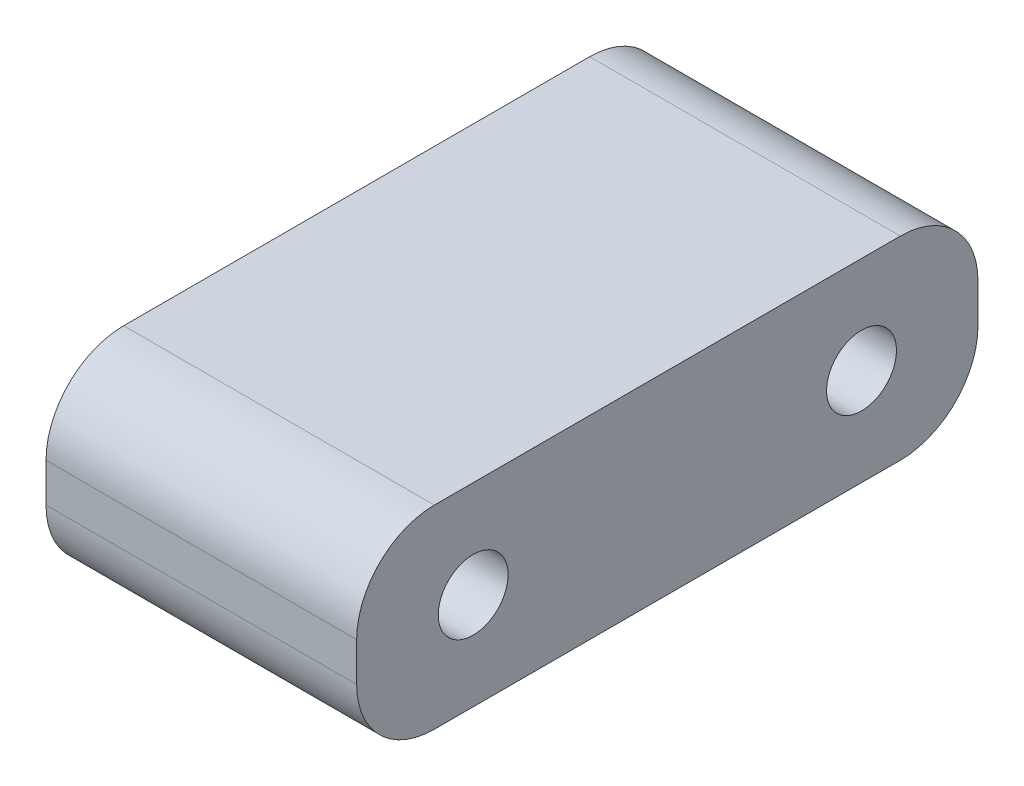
ISO-10303-21;
HEADER;
FILE_DESCRIPTION(('STEP AP214'),'2;1');
FILE_NAME('part.step','',(''),(''),'','','');
FILE_SCHEMA(('AUTOMOTIVE_DESIGN { 1 0 10303 214 1 1 1 1 }'));
ENDSEC;
DATA;
#1=APPLICATION_CONTEXT('core data for automotive mechanical design processes');
#2=APPLICATION_PROTOCOL_DEFINITION('international standard','automotive_design',2000,#1);
#3=PRODUCT_CONTEXT('',#1,'mechanical');
#4=PRODUCT('Part','Part','',(#3));
#5=PRODUCT_RELATED_PRODUCT_CATEGORY('part','',(#4));
#6=PRODUCT_DEFINITION_FORMATION('','',#4);
#7=PRODUCT_DEFINITION_CONTEXT('part definition',#1,'design');
#8=PRODUCT_DEFINITION('design','',#6,#7);
#9=PRODUCT_DEFINITION_SHAPE('','',#8);
#10=(LENGTH_UNIT() NAMED_UNIT(*) SI_UNIT(.MILLI.,.METRE.));
#11=(NAMED_UNIT(*) PLANE_ANGLE_UNIT() SI_UNIT($,.RADIAN.));
#12=(NAMED_UNIT(*) SI_UNIT($,.STERADIAN.) SOLID_ANGLE_UNIT());
#13=UNCERTAINTY_MEASURE_WITH_UNIT(LENGTH_MEASURE(1.E-05),#10,'distance_accuracy_value','');
#14=(GEOMETRIC_REPRESENTATION_CONTEXT(3) GLOBAL_UNCERTAINTY_ASSIGNED_CONTEXT((#13)) GLOBAL_UNIT_ASSIGNED_CONTEXT((#10,
#11,#12)) REPRESENTATION_CONTEXT('',''));
#15=CARTESIAN_POINT('',(0.,0.,0.));
#16=DIRECTION('',(0.,0.,1.));
#17=DIRECTION('',(1.,0.,0.));
#18=AXIS2_PLACEMENT_3D('',#15,#16,#17);
#19=CARTESIAN_POINT('',(10.,0.531417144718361,0.));
#20=DIRECTION('',(0.,1.,0.));
#21=DIRECTION('',(0.,0.,1.));
#22=AXIS2_PLACEMENT_3D('',#19,#20,#21);
#23=PLANE('',#22);
#24=DIRECTION('',(0.,0.,-1.));
#25=VECTOR('',#24,1.);
#26=CARTESIAN_POINT('',(-10.,0.531417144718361,0.));
#27=LINE('',#26,#25);
#28=CARTESIAN_POINT('',(-10.,0.531417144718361,-2.75000000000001));
#29=VERTEX_POINT('',#28);
#30=CARTESIAN_POINT('',(-10.,0.531417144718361,-32.75));
#31=VERTEX_POINT('',#30);
#32=EDGE_CURVE('E141',#29,#31,#27,.T.);
#33=ORIENTED_EDGE('',*,*,#32,.T.);
#34=DIRECTION('',(-1.,0.,0.));
#35=VECTOR('',#34,1.);
#36=CARTESIAN_POINT('',(10.,0.531417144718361,-32.75));
#37=LINE('',#36,#35);
#38=CARTESIAN_POINT('',(10.,0.531417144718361,-32.75));
#39=VERTEX_POINT('',#38);
#40=EDGE_CURVE('E11',#39,#31,#37,.T.);
#41=ORIENTED_EDGE('',*,*,#40,.F.);
#42=DIRECTION('',(0.,0.,-1.));
#43=VECTOR('',#42,1.);
#44=CARTESIAN_POINT('',(10.,0.531417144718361,0.));
#45=LINE('',#44,#43);
#46=CARTESIAN_POINT('',(10.,0.531417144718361,-2.75000000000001));
#47=VERTEX_POINT('',#46);
#48=EDGE_CURVE('E168',#47,#39,#45,.T.);
#49=ORIENTED_EDGE('',*,*,#48,.F.);
#50=DIRECTION('',(-1.,0.,0.));
#51=VECTOR('',#50,1.);
#52=CARTESIAN_POINT('',(10.,0.531417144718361,-2.75000000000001));
#53=LINE('',#52,#51);
#54=EDGE_CURVE('E137',#47,#29,#53,.T.);
#55=ORIENTED_EDGE('',*,*,#54,.T.);
#56=EDGE_LOOP('',(#33,#41,#49,#55));
#57=FACE_BOUND('',#56,.T.);
#58=ADVANCED_FACE('F40',(#57),#23,.F.);
#59=CARTESIAN_POINT('',(10.,5.53141714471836,-32.75));
#60=DIRECTION('',(-1.,0.,0.));
#61=DIRECTION('',(0.,0.,1.));
#62=AXIS2_PLACEMENT_3D('',#59,#60,#61);
#63=CYLINDRICAL_SURFACE('',#62,5.);
#64=CARTESIAN_POINT('',(-10.,5.53141714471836,-32.75));
#65=DIRECTION('',(1.,0.,0.));
#66=DIRECTION('',(0.,0.,-1.));
#67=AXIS2_PLACEMENT_3D('',#64,#65,#66);
#68=CIRCLE('',#67,5.);
#69=CARTESIAN_POINT('',(-10.,5.53141714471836,-37.75));
#70=VERTEX_POINT('',#69);
#71=EDGE_CURVE('E145',#31,#70,#68,.T.);
#72=ORIENTED_EDGE('',*,*,#71,.T.);
#73=DIRECTION('',(-1.,0.,0.));
#74=VECTOR('',#73,1.);
#75=CARTESIAN_POINT('',(10.,5.53141714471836,-37.75));
#76=LINE('',#75,#74);
#77=CARTESIAN_POINT('',(10.,5.53141714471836,-37.75));
#78=VERTEX_POINT('',#77);
#79=EDGE_CURVE('E49',#78,#70,#76,.T.);
#80=ORIENTED_EDGE('',*,*,#79,.F.);
#81=CARTESIAN_POINT('',(10.,5.53141714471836,-32.75));
#82=DIRECTION('',(1.,0.,0.));
#83=DIRECTION('',(0.,0.,-1.));
#84=AXIS2_PLACEMENT_3D('',#81,#82,#83);
#85=CIRCLE('',#84,5.);
#86=EDGE_CURVE('E100',#39,#78,#85,.T.);
#87=ORIENTED_EDGE('',*,*,#86,.F.);
#88=ORIENTED_EDGE('',*,*,#40,.T.);
#89=EDGE_LOOP('',(#72,#80,#87,#88));
#90=FACE_BOUND('',#89,.T.);
#91=ADVANCED_FACE('F187',(#90),#63,.T.);
#92=CARTESIAN_POINT('',(10.,0.,-37.75));
#93=DIRECTION('',(0.,0.,-1.));
#94=DIRECTION('',(-1.,0.,0.));
#95=AXIS2_PLACEMENT_3D('',#92,#93,#94);
#96=PLANE('',#95);
#97=DIRECTION('',(0.,-1.,0.));
#98=VECTOR('',#97,1.);
#99=CARTESIAN_POINT('',(-10.,0.,-37.75));
#100=LINE('',#99,#98);
#101=CARTESIAN_POINT('',(-10.,8.03141714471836,-37.75));
#102=VERTEX_POINT('',#101);
#103=EDGE_CURVE('E150',#102,#70,#100,.T.);
#104=ORIENTED_EDGE('',*,*,#103,.F.);
#105=DIRECTION('',(-1.,0.,0.));
#106=VECTOR('',#105,1.);
#107=CARTESIAN_POINT('',(10.,8.03141714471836,-37.75));
#108=LINE('',#107,#106);
#109=CARTESIAN_POINT('',(10.,8.03141714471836,-37.75));
#110=VERTEX_POINT('',#109);
#111=EDGE_CURVE('E178',#110,#102,#108,.T.);
#112=ORIENTED_EDGE('',*,*,#111,.F.);
#113=DIRECTION('',(0.,-1.,0.));
#114=VECTOR('',#113,1.);
#115=CARTESIAN_POINT('',(10.,0.,-37.75));
#116=LINE('',#115,#114);
#117=EDGE_CURVE('E186',#110,#78,#116,.T.);
#118=ORIENTED_EDGE('',*,*,#117,.T.);
#119=ORIENTED_EDGE('',*,*,#79,.T.);
#120=EDGE_LOOP('',(#104,#112,#118,#119));
#121=FACE_BOUND('',#120,.T.);
#122=ADVANCED_FACE('F184',(#121),#96,.T.);
#123=CARTESIAN_POINT('',(10.,8.03141714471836,-32.75));
#124=DIRECTION('',(-1.,0.,0.));
#125=DIRECTION('',(0.,0.,1.));
#126=AXIS2_PLACEMENT_3D('',#123,#124,#125);
#127=CYLINDRICAL_SURFACE('',#126,4.99999999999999);
#128=CARTESIAN_POINT('',(-10.,8.03141714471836,-32.75));
#129=DIRECTION('',(1.,0.,0.));
#130=DIRECTION('',(0.,0.,-1.));
#131=AXIS2_PLACEMENT_3D('',#128,#129,#130);
#132=CIRCLE('',#131,4.99999999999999);
#133=CARTESIAN_POINT('',(-10.,13.0314171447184,-32.75));
#134=VERTEX_POINT('',#133);
#135=EDGE_CURVE('E154',#134,#102,#132,.F.);
#136=ORIENTED_EDGE('',*,*,#135,.F.);
#137=DIRECTION('',(-1.,0.,0.));
#138=VECTOR('',#137,1.);
#139=CARTESIAN_POINT('',(10.,13.0314171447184,-32.75));
#140=LINE('',#139,#138);
#141=CARTESIAN_POINT('',(10.,13.0314171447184,-32.75));
#142=VERTEX_POINT('',#141);
#143=EDGE_CURVE('E175',#142,#134,#140,.T.);
#144=ORIENTED_EDGE('',*,*,#143,.F.);
#145=CARTESIAN_POINT('',(10.,8.03141714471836,-32.75));
#146=DIRECTION('',(1.,0.,0.));
#147=DIRECTION('',(0.,0.,-1.));
#148=AXIS2_PLACEMENT_3D('',#145,#146,#147);
#149=CIRCLE('',#148,4.99999999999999);
#150=EDGE_CURVE('E197',#142,#110,#149,.F.);
#151=ORIENTED_EDGE('',*,*,#150,.T.);
#152=ORIENTED_EDGE('',*,*,#111,.T.);
#153=EDGE_LOOP('',(#136,#144,#151,#152));
#154=FACE_BOUND('',#153,.T.);
#155=ADVANCED_FACE('F195',(#154),#127,.T.);
#156=CARTESIAN_POINT('',(10.,13.0314171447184,0.));
#157=DIRECTION('',(0.,1.,0.));
#158=DIRECTION('',(0.,0.,1.));
#159=AXIS2_PLACEMENT_3D('',#156,#157,#158);
#160=PLANE('',#159);
#161=DIRECTION('',(0.,0.,-1.));
#162=VECTOR('',#161,1.);
#163=CARTESIAN_POINT('',(-10.,13.0314171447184,0.));
#164=LINE('',#163,#162);
#165=CARTESIAN_POINT('',(-10.,13.0314171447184,-2.75000000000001));
#166=VERTEX_POINT('',#165);
#167=EDGE_CURVE('E158',#166,#134,#164,.T.);
#168=ORIENTED_EDGE('',*,*,#167,.F.);
#169=DIRECTION('',(-1.,0.,0.));
#170=VECTOR('',#169,1.);
#171=CARTESIAN_POINT('',(10.,13.0314171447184,-2.75000000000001));
#172=LINE('',#171,#170);
#173=CARTESIAN_POINT('',(10.,13.0314171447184,-2.75000000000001));
#174=VERTEX_POINT('',#173);
#175=EDGE_CURVE('E130',#174,#166,#172,.T.);
#176=ORIENTED_EDGE('',*,*,#175,.F.);
#177=DIRECTION('',(0.,0.,-1.));
#178=VECTOR('',#177,1.);
#179=CARTESIAN_POINT('',(10.,13.0314171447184,0.));
#180=LINE('',#179,#178);
#181=EDGE_CURVE('E121',#174,#142,#180,.T.);
#182=ORIENTED_EDGE('',*,*,#181,.T.);
#183=ORIENTED_EDGE('',*,*,#143,.T.);
#184=EDGE_LOOP('',(#168,#176,#182,#183));
#185=FACE_BOUND('',#184,.T.);
#186=ADVANCED_FACE('F207',(#185),#160,.T.);
#187=CARTESIAN_POINT('',(10.,8.03141714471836,-2.75000000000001));
#188=DIRECTION('',(-1.,0.,0.));
#189=DIRECTION('',(0.,0.,1.));
#190=AXIS2_PLACEMENT_3D('',#187,#188,#189);
#191=CYLINDRICAL_SURFACE('',#190,5.);
#192=CARTESIAN_POINT('',(-10.,8.03141714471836,-2.75000000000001));
#193=DIRECTION('',(1.,0.,0.));
#194=DIRECTION('',(0.,0.,-1.));
#195=AXIS2_PLACEMENT_3D('',#192,#193,#194);
#196=CIRCLE('',#195,5.);
#197=CARTESIAN_POINT('',(-10.,8.03141714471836,2.25));
#198=VERTEX_POINT('',#197);
#199=EDGE_CURVE('E128',#166,#198,#196,.T.);
#200=ORIENTED_EDGE('',*,*,#199,.T.);
#201=DIRECTION('',(-1.,0.,0.));
#202=VECTOR('',#201,1.);
#203=CARTESIAN_POINT('',(10.,8.03141714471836,2.25));
#204=LINE('',#203,#202);
#205=CARTESIAN_POINT('',(10.,8.03141714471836,2.25));
#206=VERTEX_POINT('',#205);
#207=EDGE_CURVE('E125',#206,#198,#204,.T.);
#208=ORIENTED_EDGE('',*,*,#207,.F.);
#209=CARTESIAN_POINT('',(10.,8.03141714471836,-2.75000000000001));
#210=DIRECTION('',(1.,0.,0.));
#211=DIRECTION('',(0.,0.,-1.));
#212=AXIS2_PLACEMENT_3D('',#209,#210,#211);
#213=CIRCLE('',#212,5.);
#214=EDGE_CURVE('E114',#174,#206,#213,.T.);
#215=ORIENTED_EDGE('',*,*,#214,.F.);
#216=ORIENTED_EDGE('',*,*,#175,.T.);
#217=EDGE_LOOP('',(#200,#208,#215,#216));
#218=FACE_BOUND('',#217,.T.);
#219=ADVANCED_FACE('F126',(#218),#191,.T.);
#220=CARTESIAN_POINT('',(10.,0.,2.24999999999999));
#221=DIRECTION('',(0.,0.,-1.));
#222=DIRECTION('',(0.,1.,0.));
#223=AXIS2_PLACEMENT_3D('',#220,#221,#222);
#224=PLANE('',#223);
#225=DIRECTION('',(0.,-1.,0.));
#226=VECTOR('',#225,1.);
#227=CARTESIAN_POINT('',(-10.,0.,2.24999999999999));
#228=LINE('',#227,#226);
#229=CARTESIAN_POINT('',(-10.,5.53141714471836,2.24999999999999));
#230=VERTEX_POINT('',#229);
#231=EDGE_CURVE('E86',#198,#230,#228,.T.);
#232=ORIENTED_EDGE('',*,*,#231,.T.);
#233=DIRECTION('',(-1.,0.,0.));
#234=VECTOR('',#233,1.);
#235=CARTESIAN_POINT('',(10.,5.53141714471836,2.24999999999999));
#236=LINE('',#235,#234);
#237=CARTESIAN_POINT('',(10.,5.53141714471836,2.24999999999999));
#238=VERTEX_POINT('',#237);
#239=EDGE_CURVE('E131',#238,#230,#236,.T.);
#240=ORIENTED_EDGE('',*,*,#239,.F.);
#241=DIRECTION('',(0.,-1.,0.));
#242=VECTOR('',#241,1.);
#243=CARTESIAN_POINT('',(10.,0.,2.24999999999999));
#244=LINE('',#243,#242);
#245=EDGE_CURVE('E118',#206,#238,#244,.T.);
#246=ORIENTED_EDGE('',*,*,#245,.F.);
#247=ORIENTED_EDGE('',*,*,#207,.T.);
#248=EDGE_LOOP('',(#232,#240,#246,#247));
#249=FACE_BOUND('',#248,.T.);
#250=ADVANCED_FACE('F133',(#249),#224,.F.);
#251=CARTESIAN_POINT('',(10.,5.53141714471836,-2.75000000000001));
#252=DIRECTION('',(-1.,0.,0.));
#253=DIRECTION('',(0.,0.,1.));
#254=AXIS2_PLACEMENT_3D('',#251,#252,#253);
#255=CYLINDRICAL_SURFACE('',#254,5.);
#256=CARTESIAN_POINT('',(-10.,5.53141714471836,-2.75000000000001));
#257=DIRECTION('',(1.,0.,0.));
#258=DIRECTION('',(0.,0.,-1.));
#259=AXIS2_PLACEMENT_3D('',#256,#257,#258);
#260=CIRCLE('',#259,5.);
#261=EDGE_CURVE('E92',#230,#29,#260,.T.);
#262=ORIENTED_EDGE('',*,*,#261,.T.);
#263=ORIENTED_EDGE('',*,*,#54,.F.);
#264=CARTESIAN_POINT('',(10.,5.53141714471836,-2.75000000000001));
#265=DIRECTION('',(1.,0.,0.));
#266=DIRECTION('',(0.,0.,-1.));
#267=AXIS2_PLACEMENT_3D('',#264,#265,#266);
#268=CIRCLE('',#267,5.);
#269=EDGE_CURVE('E57',#238,#47,#268,.T.);
#270=ORIENTED_EDGE('',*,*,#269,.F.);
#271=ORIENTED_EDGE('',*,*,#239,.T.);
#272=EDGE_LOOP('',(#262,#263,#270,#271));
#273=FACE_BOUND('',#272,.T.);
#274=ADVANCED_FACE('F210',(#273),#255,.T.);
#275=CARTESIAN_POINT('',(10.,0.,0.));
#276=DIRECTION('',(1.,0.,0.));
#277=DIRECTION('',(0.,0.,-1.));
#278=AXIS2_PLACEMENT_3D('',#275,#276,#277);
#279=PLANE('',#278);
#280=CARTESIAN_POINT('',(10.,6.78141714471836,-5.25000000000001));
#281=DIRECTION('',(1.,0.,0.));
#282=DIRECTION('',(0.,0.,-1.));
#283=AXIS2_PLACEMENT_3D('',#280,#281,#282);
#284=CIRCLE('',#283,2.25);
#285=CARTESIAN_POINT('',(10.,6.78141714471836,-7.50000000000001));
#286=VERTEX_POINT('',#285);
#287=EDGE_CURVE('E292',#286,#286,#284,.T.);
#288=ORIENTED_EDGE('',*,*,#287,.F.);
#289=EDGE_LOOP('',(#288));
#290=FACE_BOUND('',#289,.T.);
#291=CARTESIAN_POINT('',(10.,6.78141714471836,-30.25));
#292=DIRECTION('',(1.,0.,0.));
#293=DIRECTION('',(0.,0.,-1.));
#294=AXIS2_PLACEMENT_3D('',#291,#292,#293);
#295=CIRCLE('',#294,2.25);
#296=CARTESIAN_POINT('',(10.,6.78141714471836,-32.5));
#297=VERTEX_POINT('',#296);
#298=EDGE_CURVE('E300',#297,#297,#295,.T.);
#299=ORIENTED_EDGE('',*,*,#298,.F.);
#300=EDGE_LOOP('',(#299));
#301=FACE_BOUND('',#300,.T.);
#302=ORIENTED_EDGE('',*,*,#48,.T.);
#303=ORIENTED_EDGE('',*,*,#86,.T.);
#304=ORIENTED_EDGE('',*,*,#117,.F.);
#305=ORIENTED_EDGE('',*,*,#150,.F.);
#306=ORIENTED_EDGE('',*,*,#181,.F.);
#307=ORIENTED_EDGE('',*,*,#214,.T.);
#308=ORIENTED_EDGE('',*,*,#245,.T.);
#309=ORIENTED_EDGE('',*,*,#269,.T.);
#310=EDGE_LOOP('',(#302,#303,#304,#305,#306,#307,#308,#309));
#311=FACE_BOUND('',#310,.T.);
#312=ADVANCED_FACE('F116',(#290,#301,#311),#279,.T.);
#313=CARTESIAN_POINT('',(-10.,0.,0.));
#314=DIRECTION('',(1.,0.,0.));
#315=DIRECTION('',(0.,0.,-1.));
#316=AXIS2_PLACEMENT_3D('',#313,#314,#315);
#317=PLANE('',#316);
#318=CARTESIAN_POINT('',(-10.,6.78141714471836,-5.25000000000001));
#319=DIRECTION('',(1.,0.,0.));
#320=DIRECTION('',(0.,0.,-1.));
#321=AXIS2_PLACEMENT_3D('',#318,#319,#320);
#322=CIRCLE('',#321,2.25);
#323=CARTESIAN_POINT('',(-10.,6.78141714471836,-7.50000000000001));
#324=VERTEX_POINT('',#323);
#325=EDGE_CURVE('E146',#324,#324,#322,.T.);
#326=ORIENTED_EDGE('',*,*,#325,.T.);
#327=EDGE_LOOP('',(#326));
#328=FACE_BOUND('',#327,.T.);
#329=CARTESIAN_POINT('',(-10.,6.78141714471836,-30.25));
#330=DIRECTION('',(1.,0.,0.));
#331=DIRECTION('',(0.,0.,-1.));
#332=AXIS2_PLACEMENT_3D('',#329,#330,#331);
#333=CIRCLE('',#332,2.25);
#334=CARTESIAN_POINT('',(-10.,6.78141714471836,-32.5));
#335=VERTEX_POINT('',#334);
#336=EDGE_CURVE('E294',#335,#335,#333,.T.);
#337=ORIENTED_EDGE('',*,*,#336,.T.);
#338=EDGE_LOOP('',(#337));
#339=FACE_BOUND('',#338,.T.);
#340=ORIENTED_EDGE('',*,*,#32,.F.);
#341=ORIENTED_EDGE('',*,*,#261,.F.);
#342=ORIENTED_EDGE('',*,*,#231,.F.);
#343=ORIENTED_EDGE('',*,*,#199,.F.);
#344=ORIENTED_EDGE('',*,*,#167,.T.);
#345=ORIENTED_EDGE('',*,*,#135,.T.);
#346=ORIENTED_EDGE('',*,*,#103,.T.);
#347=ORIENTED_EDGE('',*,*,#71,.F.);
#348=EDGE_LOOP('',(#340,#341,#342,#343,#344,#345,#346,#347));
#349=FACE_BOUND('',#348,.T.);
#350=ADVANCED_FACE('F191',(#328,#339,#349),#317,.F.);
#351=CARTESIAN_POINT('',(-10.,6.78141714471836,-30.25));
#352=DIRECTION('',(1.,0.,0.));
#353=DIRECTION('',(0.,0.,-1.));
#354=AXIS2_PLACEMENT_3D('',#351,#352,#353);
#355=CYLINDRICAL_SURFACE('',#354,2.25);
#356=ORIENTED_EDGE('',*,*,#336,.F.);
#357=EDGE_LOOP('',(#356));
#358=FACE_BOUND('',#357,.T.);
#359=ORIENTED_EDGE('',*,*,#298,.T.);
#360=EDGE_LOOP('',(#359));
#361=FACE_BOUND('',#360,.T.);
#362=ADVANCED_FACE('F265',(#358,#361),#355,.F.);
#363=CARTESIAN_POINT('',(-10.,6.78141714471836,-5.25000000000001));
#364=DIRECTION('',(1.,0.,0.));
#365=DIRECTION('',(0.,0.,-1.));
#366=AXIS2_PLACEMENT_3D('',#363,#364,#365);
#367=CYLINDRICAL_SURFACE('',#366,2.25);
#368=ORIENTED_EDGE('',*,*,#325,.F.);
#369=EDGE_LOOP('',(#368));
#370=FACE_BOUND('',#369,.T.);
#371=ORIENTED_EDGE('',*,*,#287,.T.);
#372=EDGE_LOOP('',(#371));
#373=FACE_BOUND('',#372,.T.);
#374=ADVANCED_FACE('F274',(#370,#373),#367,.F.);
#375=CLOSED_SHELL('',(#58,#91,#122,#155,#186,#219,#250,#274,#312,#350,#362,#374));
#376=MANIFOLD_SOLID_BREP('B2',#375);
#377=ADVANCED_BREP_SHAPE_REPRESENTATION('',(#18,#376),#14);
#378=SHAPE_DEFINITION_REPRESENTATION(#9,#377);
ENDSEC;
END-ISO-10303-21;
